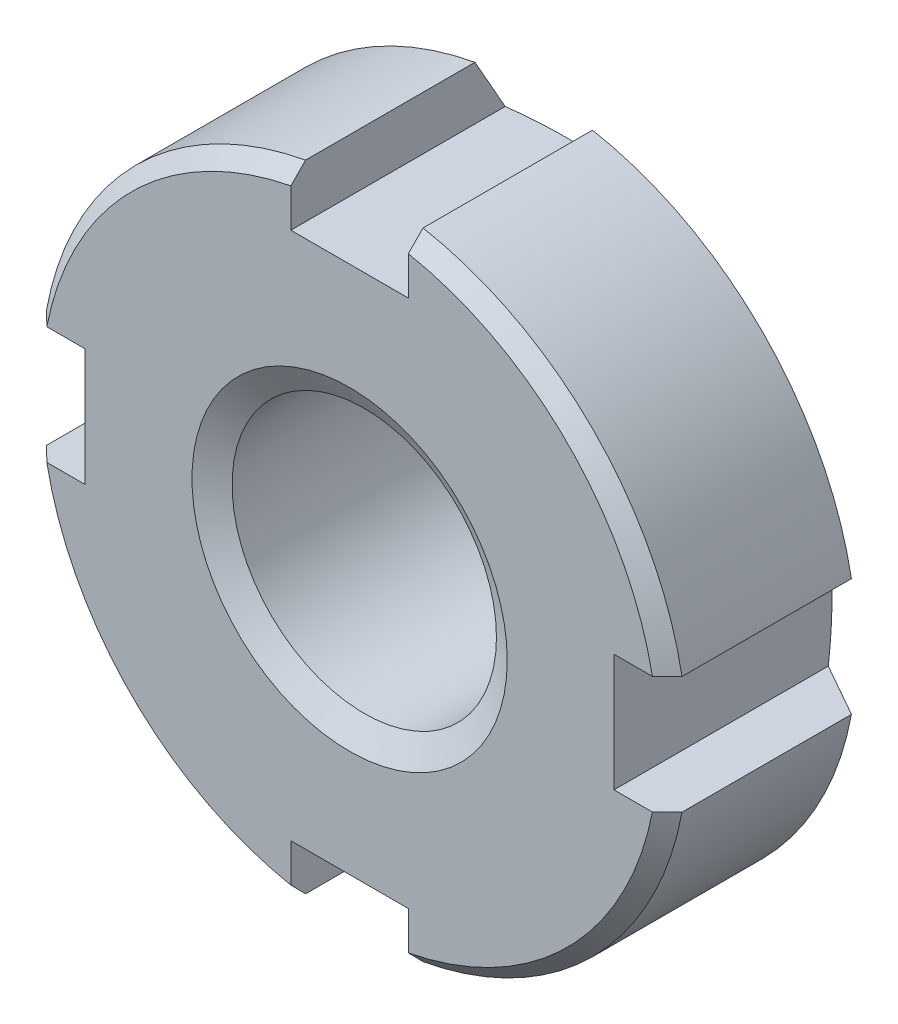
from build123d import *

# Parameters (mm, degrees)
SKETCH1_R        = 11
SKETCH1_R_2      = 4.5
BASENUT_DEPTH    = 8
CHAMFER1_SIZE    = 0.5
ENDCHAMFER_SIZE  = 0.866025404
ENDCHAMFER_SIZE2 = 0.5
CHAMFER2_SIZE    = 0.7
SLOTCUT_DEPTH    = 23.467199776
SLOTPAT_COUNT    = 4


with BuildPart() as part:
    # Sketch1 → BaseNut (new body)
    with BuildSketch(Plane.XY):
        Circle(SKETCH1_R)
        Circle(SKETCH1_R_2, mode=Mode.SUBTRACT)
    extrude(amount=-BASENUT_DEPTH)

    # Sketch2 → StepCut (revolve, cut)
    with BuildSketch(Plane(origin=(0, 0, 0), x_dir=(1, 0, 0), z_dir=(0, 1, 0)), mode=Mode.PRIVATE) as stepcut_sk:
        Polygon((-11, 8), (-8, 8), (-11, 6.267949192), align=None)
    revolve(stepcut_sk.sketch.rotate(Axis((0, 0, -4.560481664), (0, 0, 1)), 180), axis=Axis((0, 0, -4.560481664), (0, 0, 1)), mode=Mode.SUBTRACT)

    # Chamfer1
    chamfer1_edges = [part.edges().sort_by_distance(p)[0] for p in [
        (-11, 0, 0),
    ]]
    chamfer(chamfer1_edges, length=CHAMFER1_SIZE)

    # EndChamfer
    endchamfer_edges = [part.edges().sort_by_distance(p)[0] for p in [
        (-4.5, 0, 0),
    ]]
    endchamfer_side = [part.faces().sort_by_distance(p)[0] for p in [
        (-10.203015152, 0, 0),
    ]]
    chamfer(endchamfer_edges, length=ENDCHAMFER_SIZE, length2=ENDCHAMFER_SIZE2, reference=endchamfer_side[0])

    # Chamfer2
    chamfer2_edges = [part.edges().sort_by_distance(p)[0] for p in [
        (-4.5, 0, -8),
    ]]
    chamfer(chamfer2_edges, length=CHAMFER2_SIZE)

    # Sketch3 → SlotCut (cut, through all)
    with BuildSketch(Plane(origin=(-3.554280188, 4.131027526, -8), x_dir=(-1, 0, 0), z_dir=(0, 0, -1))):
        with BuildLine():
            Line((-5.554280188, -13.131027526), (-1.554280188, -13.131027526))
            Line((-1.554280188, -13.131027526), (-1.554280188, -14.947681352))
            ThreePointArc((-1.554280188, -14.947681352), (-3.554280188, -15.131027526), (-5.554280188, -14.947681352))
            Line((-5.554280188, -14.947681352), (-5.554280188, -13.131027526))
        make_face()
    slotcut = extrude(amount=-SLOTCUT_DEPTH, mode=Mode.SUBTRACT)

    # SlotPat: SlotCut ×4 about axis
    slotpat_axis = Axis((0, 0, -4.560481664), (0, 0, 1))
    for i in range(1, SLOTPAT_COUNT):
        add(slotcut.rotate(slotpat_axis, i * 360 / SLOTPAT_COUNT), mode=Mode.SUBTRACT)


solid = part.part
